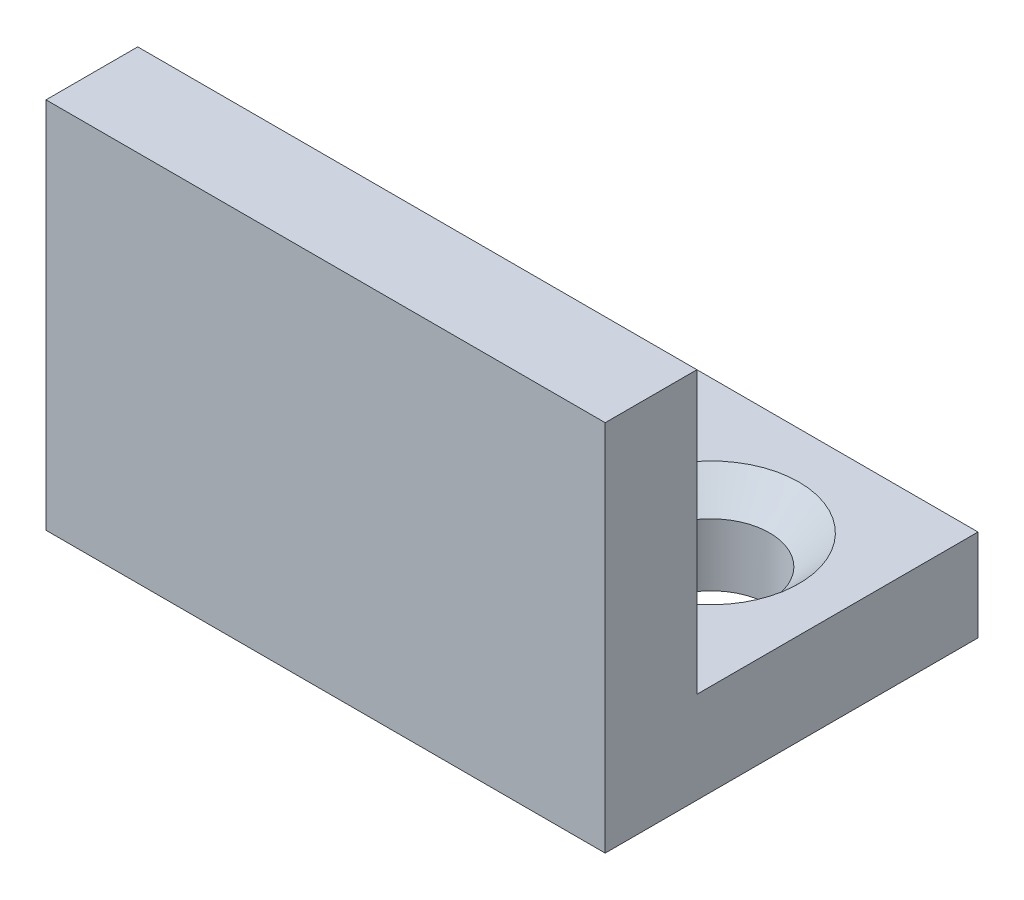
ISO-10303-21;
HEADER;
FILE_DESCRIPTION(('STEP AP214'),'2;1');
FILE_NAME('part.step','',(''),(''),'','','');
FILE_SCHEMA(('AUTOMOTIVE_DESIGN { 1 0 10303 214 1 1 1 1 }'));
ENDSEC;
DATA;
#1=APPLICATION_CONTEXT('core data for automotive mechanical design processes');
#2=APPLICATION_PROTOCOL_DEFINITION('international standard','automotive_design',2000,#1);
#3=PRODUCT_CONTEXT('',#1,'mechanical');
#4=PRODUCT('Part','Part','',(#3));
#5=PRODUCT_RELATED_PRODUCT_CATEGORY('part','',(#4));
#6=PRODUCT_DEFINITION_FORMATION('','',#4);
#7=PRODUCT_DEFINITION_CONTEXT('part definition',#1,'design');
#8=PRODUCT_DEFINITION('design','',#6,#7);
#9=PRODUCT_DEFINITION_SHAPE('','',#8);
#10=(LENGTH_UNIT() NAMED_UNIT(*) SI_UNIT(.MILLI.,.METRE.));
#11=(NAMED_UNIT(*) PLANE_ANGLE_UNIT() SI_UNIT($,.RADIAN.));
#12=(NAMED_UNIT(*) SI_UNIT($,.STERADIAN.) SOLID_ANGLE_UNIT());
#13=UNCERTAINTY_MEASURE_WITH_UNIT(LENGTH_MEASURE(1.E-05),#10,'distance_accuracy_value','');
#14=(GEOMETRIC_REPRESENTATION_CONTEXT(3) GLOBAL_UNCERTAINTY_ASSIGNED_CONTEXT((#13)) GLOBAL_UNIT_ASSIGNED_CONTEXT((#10,
#11,#12)) REPRESENTATION_CONTEXT('',''));
#15=CARTESIAN_POINT('',(0.,0.,0.));
#16=DIRECTION('',(0.,0.,1.));
#17=DIRECTION('',(1.,0.,0.));
#18=AXIS2_PLACEMENT_3D('',#15,#16,#17);
#19=CARTESIAN_POINT('',(9.525,0.,0.));
#20=DIRECTION('',(0.,1.,0.));
#21=DIRECTION('',(0.,0.,1.));
#22=AXIS2_PLACEMENT_3D('',#19,#20,#21);
#23=PLANE('',#22);
#24=CARTESIAN_POINT('',(5.,0.,-5.));
#25=DIRECTION('',(0.,1.,0.));
#26=DIRECTION('',(0.,0.,1.));
#27=AXIS2_PLACEMENT_3D('',#24,#25,#26);
#28=CIRCLE('',#27,3.00000000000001);
#29=CARTESIAN_POINT('',(5.,0.,-1.99999999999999));
#30=VERTEX_POINT('',#29);
#31=EDGE_CURVE('E41',#30,#30,#28,.F.);
#32=ORIENTED_EDGE('',*,*,#31,.T.);
#33=EDGE_LOOP('',(#32));
#34=FACE_BOUND('',#33,.T.);
#35=CARTESIAN_POINT('',(-5.,0.,-5.));
#36=DIRECTION('',(0.,1.,0.));
#37=DIRECTION('',(0.,0.,1.));
#38=AXIS2_PLACEMENT_3D('',#35,#36,#37);
#39=CIRCLE('',#38,3.00000000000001);
#40=CARTESIAN_POINT('',(-5.,0.,-1.99999999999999));
#41=VERTEX_POINT('',#40);
#42=EDGE_CURVE('E146',#41,#41,#39,.F.);
#43=ORIENTED_EDGE('',*,*,#42,.T.);
#44=EDGE_LOOP('',(#43));
#45=FACE_BOUND('',#44,.T.);
#46=DIRECTION('',(0.,0.,-1.));
#47=VECTOR('',#46,1.);
#48=CARTESIAN_POINT('',(-9.525,0.,0.));
#49=LINE('',#48,#47);
#50=CARTESIAN_POINT('',(-9.525,0.,0.));
#51=VERTEX_POINT('',#50);
#52=CARTESIAN_POINT('',(-9.525,0.,-9.575));
#53=VERTEX_POINT('',#52);
#54=EDGE_CURVE('E120',#51,#53,#49,.T.);
#55=ORIENTED_EDGE('',*,*,#54,.F.);
#56=DIRECTION('',(-1.,0.,0.));
#57=VECTOR('',#56,1.);
#58=CARTESIAN_POINT('',(9.525,0.,0.));
#59=LINE('',#58,#57);
#60=CARTESIAN_POINT('',(9.525,0.,0.));
#61=VERTEX_POINT('',#60);
#62=EDGE_CURVE('E49',#61,#51,#59,.T.);
#63=ORIENTED_EDGE('',*,*,#62,.F.);
#64=DIRECTION('',(0.,0.,-1.));
#65=VECTOR('',#64,1.);
#66=CARTESIAN_POINT('',(9.525,0.,0.));
#67=LINE('',#66,#65);
#68=CARTESIAN_POINT('',(9.525,0.,-9.575));
#69=VERTEX_POINT('',#68);
#70=EDGE_CURVE('E136',#61,#69,#67,.T.);
#71=ORIENTED_EDGE('',*,*,#70,.T.);
#72=DIRECTION('',(-1.,0.,0.));
#73=VECTOR('',#72,1.);
#74=CARTESIAN_POINT('',(9.525,0.,-9.575));
#75=LINE('',#74,#73);
#76=EDGE_CURVE('E84',#69,#53,#75,.T.);
#77=ORIENTED_EDGE('',*,*,#76,.T.);
#78=EDGE_LOOP('',(#55,#63,#71,#77));
#79=FACE_BOUND('',#78,.T.);
#80=ADVANCED_FACE('F32',(#34,#45,#79),#23,.T.);
#81=CARTESIAN_POINT('',(9.525,9.57499999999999,0.));
#82=DIRECTION('',(0.,0.,-1.));
#83=DIRECTION('',(0.,1.,0.));
#84=AXIS2_PLACEMENT_3D('',#81,#82,#83);
#85=PLANE('',#84);
#86=DIRECTION('',(0.,-1.,0.));
#87=VECTOR('',#86,1.);
#88=CARTESIAN_POINT('',(-9.525,9.57499999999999,0.));
#89=LINE('',#88,#87);
#90=CARTESIAN_POINT('',(-9.525,9.57499999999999,0.));
#91=VERTEX_POINT('',#90);
#92=EDGE_CURVE('E133',#91,#51,#89,.T.);
#93=ORIENTED_EDGE('',*,*,#92,.F.);
#94=DIRECTION('',(-1.,0.,0.));
#95=VECTOR('',#94,1.);
#96=CARTESIAN_POINT('',(9.525,9.57499999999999,0.));
#97=LINE('',#96,#95);
#98=CARTESIAN_POINT('',(9.525,9.57499999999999,0.));
#99=VERTEX_POINT('',#98);
#100=EDGE_CURVE('E72',#99,#91,#97,.T.);
#101=ORIENTED_EDGE('',*,*,#100,.F.);
#102=DIRECTION('',(0.,-1.,0.));
#103=VECTOR('',#102,1.);
#104=CARTESIAN_POINT('',(9.525,9.57499999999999,0.));
#105=LINE('',#104,#103);
#106=EDGE_CURVE('E110',#99,#61,#105,.T.);
#107=ORIENTED_EDGE('',*,*,#106,.T.);
#108=ORIENTED_EDGE('',*,*,#62,.T.);
#109=EDGE_LOOP('',(#93,#101,#107,#108));
#110=FACE_BOUND('',#109,.T.);
#111=ADVANCED_FACE('F175',(#110),#85,.T.);
#112=CARTESIAN_POINT('',(9.525,9.57499999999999,3.125));
#113=DIRECTION('',(0.,1.,0.));
#114=DIRECTION('',(0.,0.,1.));
#115=AXIS2_PLACEMENT_3D('',#112,#113,#114);
#116=PLANE('',#115);
#117=DIRECTION('',(0.,0.,-1.));
#118=VECTOR('',#117,1.);
#119=CARTESIAN_POINT('',(-9.525,9.57499999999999,3.125));
#120=LINE('',#119,#118);
#121=CARTESIAN_POINT('',(-9.525,9.57499999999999,3.125));
#122=VERTEX_POINT('',#121);
#123=EDGE_CURVE('E97',#122,#91,#120,.T.);
#124=ORIENTED_EDGE('',*,*,#123,.F.);
#125=DIRECTION('',(-1.,0.,0.));
#126=VECTOR('',#125,1.);
#127=CARTESIAN_POINT('',(9.525,9.57499999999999,3.125));
#128=LINE('',#127,#126);
#129=CARTESIAN_POINT('',(9.525,9.57499999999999,3.125));
#130=VERTEX_POINT('',#129);
#131=EDGE_CURVE('E92',#130,#122,#128,.T.);
#132=ORIENTED_EDGE('',*,*,#131,.F.);
#133=DIRECTION('',(0.,0.,-1.));
#134=VECTOR('',#133,1.);
#135=CARTESIAN_POINT('',(9.525,9.57499999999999,3.125));
#136=LINE('',#135,#134);
#137=EDGE_CURVE('E95',#130,#99,#136,.T.);
#138=ORIENTED_EDGE('',*,*,#137,.T.);
#139=ORIENTED_EDGE('',*,*,#100,.T.);
#140=EDGE_LOOP('',(#124,#132,#138,#139));
#141=FACE_BOUND('',#140,.T.);
#142=ADVANCED_FACE('F94',(#141),#116,.T.);
#143=CARTESIAN_POINT('',(9.525,-3.12500000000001,3.125));
#144=DIRECTION('',(0.,0.,1.));
#145=DIRECTION('',(1.,0.,0.));
#146=AXIS2_PLACEMENT_3D('',#143,#144,#145);
#147=PLANE('',#146);
#148=DIRECTION('',(0.,1.,0.));
#149=VECTOR('',#148,1.);
#150=CARTESIAN_POINT('',(-9.525,-3.12500000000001,3.125));
#151=LINE('',#150,#149);
#152=CARTESIAN_POINT('',(-9.525,-3.12500000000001,3.125));
#153=VERTEX_POINT('',#152);
#154=EDGE_CURVE('E130',#153,#122,#151,.T.);
#155=ORIENTED_EDGE('',*,*,#154,.F.);
#156=DIRECTION('',(-1.,0.,0.));
#157=VECTOR('',#156,1.);
#158=CARTESIAN_POINT('',(9.525,-3.12500000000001,3.125));
#159=LINE('',#158,#157);
#160=CARTESIAN_POINT('',(9.525,-3.12500000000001,3.125));
#161=VERTEX_POINT('',#160);
#162=EDGE_CURVE('E102',#161,#153,#159,.T.);
#163=ORIENTED_EDGE('',*,*,#162,.F.);
#164=DIRECTION('',(0.,1.,0.));
#165=VECTOR('',#164,1.);
#166=CARTESIAN_POINT('',(9.525,-3.12500000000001,3.125));
#167=LINE('',#166,#165);
#168=EDGE_CURVE('E108',#161,#130,#167,.T.);
#169=ORIENTED_EDGE('',*,*,#168,.T.);
#170=ORIENTED_EDGE('',*,*,#131,.T.);
#171=EDGE_LOOP('',(#155,#163,#169,#170));
#172=FACE_BOUND('',#171,.T.);
#173=ADVANCED_FACE('F112',(#172),#147,.T.);
#174=CARTESIAN_POINT('',(9.525,-3.125,-9.575));
#175=DIRECTION('',(0.,-1.,0.));
#176=DIRECTION('',(0.,0.,-1.));
#177=AXIS2_PLACEMENT_3D('',#174,#175,#176);
#178=PLANE('',#177);
#179=CARTESIAN_POINT('',(5.,-3.125,-5.));
#180=DIRECTION('',(0.,-1.,0.));
#181=DIRECTION('',(0.,0.,-1.));
#182=AXIS2_PLACEMENT_3D('',#179,#180,#181);
#183=CIRCLE('',#182,2.);
#184=CARTESIAN_POINT('',(5.,-3.125,-7.));
#185=VERTEX_POINT('',#184);
#186=EDGE_CURVE('E165',#185,#185,#183,.F.);
#187=ORIENTED_EDGE('',*,*,#186,.T.);
#188=EDGE_LOOP('',(#187));
#189=FACE_BOUND('',#188,.T.);
#190=CARTESIAN_POINT('',(-5.,-3.125,-5.));
#191=DIRECTION('',(0.,-1.,0.));
#192=DIRECTION('',(0.,0.,-1.));
#193=AXIS2_PLACEMENT_3D('',#190,#191,#192);
#194=CIRCLE('',#193,2.);
#195=CARTESIAN_POINT('',(-5.,-3.125,-7.));
#196=VERTEX_POINT('',#195);
#197=EDGE_CURVE('E124',#196,#196,#194,.F.);
#198=ORIENTED_EDGE('',*,*,#197,.T.);
#199=EDGE_LOOP('',(#198));
#200=FACE_BOUND('',#199,.T.);
#201=DIRECTION('',(0.,0.,1.));
#202=VECTOR('',#201,1.);
#203=CARTESIAN_POINT('',(-9.525,-3.125,-9.575));
#204=LINE('',#203,#202);
#205=CARTESIAN_POINT('',(-9.525,-3.125,-9.575));
#206=VERTEX_POINT('',#205);
#207=EDGE_CURVE('E127',#206,#153,#204,.T.);
#208=ORIENTED_EDGE('',*,*,#207,.F.);
#209=DIRECTION('',(-1.,0.,0.));
#210=VECTOR('',#209,1.);
#211=CARTESIAN_POINT('',(9.525,-3.125,-9.575));
#212=LINE('',#211,#210);
#213=CARTESIAN_POINT('',(9.525,-3.125,-9.575));
#214=VERTEX_POINT('',#213);
#215=EDGE_CURVE('E141',#214,#206,#212,.T.);
#216=ORIENTED_EDGE('',*,*,#215,.F.);
#217=DIRECTION('',(0.,0.,1.));
#218=VECTOR('',#217,1.);
#219=CARTESIAN_POINT('',(9.525,-3.125,-9.575));
#220=LINE('',#219,#218);
#221=EDGE_CURVE('E113',#214,#161,#220,.T.);
#222=ORIENTED_EDGE('',*,*,#221,.T.);
#223=ORIENTED_EDGE('',*,*,#162,.T.);
#224=EDGE_LOOP('',(#208,#216,#222,#223));
#225=FACE_BOUND('',#224,.T.);
#226=ADVANCED_FACE('F189',(#189,#200,#225),#178,.T.);
#227=CARTESIAN_POINT('',(9.525,0.,-9.575));
#228=DIRECTION('',(0.,0.,-1.));
#229=DIRECTION('',(-1.,0.,0.));
#230=AXIS2_PLACEMENT_3D('',#227,#228,#229);
#231=PLANE('',#230);
#232=DIRECTION('',(0.,-1.,0.));
#233=VECTOR('',#232,1.);
#234=CARTESIAN_POINT('',(-9.525,0.,-9.575));
#235=LINE('',#234,#233);
#236=EDGE_CURVE('E123',#53,#206,#235,.T.);
#237=ORIENTED_EDGE('',*,*,#236,.F.);
#238=ORIENTED_EDGE('',*,*,#76,.F.);
#239=DIRECTION('',(0.,-1.,0.));
#240=VECTOR('',#239,1.);
#241=CARTESIAN_POINT('',(9.525,0.,-9.575));
#242=LINE('',#241,#240);
#243=EDGE_CURVE('E115',#69,#214,#242,.T.);
#244=ORIENTED_EDGE('',*,*,#243,.T.);
#245=ORIENTED_EDGE('',*,*,#215,.T.);
#246=EDGE_LOOP('',(#237,#238,#244,#245));
#247=FACE_BOUND('',#246,.T.);
#248=ADVANCED_FACE('F171',(#247),#231,.T.);
#249=CARTESIAN_POINT('',(9.525,0.,0.));
#250=DIRECTION('',(-1.,0.,0.));
#251=DIRECTION('',(0.,0.,1.));
#252=AXIS2_PLACEMENT_3D('',#249,#250,#251);
#253=PLANE('',#252);
#254=ORIENTED_EDGE('',*,*,#70,.F.);
#255=ORIENTED_EDGE('',*,*,#106,.F.);
#256=ORIENTED_EDGE('',*,*,#137,.F.);
#257=ORIENTED_EDGE('',*,*,#168,.F.);
#258=ORIENTED_EDGE('',*,*,#221,.F.);
#259=ORIENTED_EDGE('',*,*,#243,.F.);
#260=EDGE_LOOP('',(#254,#255,#256,#257,#258,#259));
#261=FACE_BOUND('',#260,.T.);
#262=ADVANCED_FACE('F106',(#261),#253,.F.);
#263=CARTESIAN_POINT('',(-9.525,0.,0.));
#264=DIRECTION('',(-1.,0.,0.));
#265=DIRECTION('',(0.,0.,1.));
#266=AXIS2_PLACEMENT_3D('',#263,#264,#265);
#267=PLANE('',#266);
#268=ORIENTED_EDGE('',*,*,#54,.T.);
#269=ORIENTED_EDGE('',*,*,#236,.T.);
#270=ORIENTED_EDGE('',*,*,#207,.T.);
#271=ORIENTED_EDGE('',*,*,#154,.T.);
#272=ORIENTED_EDGE('',*,*,#123,.T.);
#273=ORIENTED_EDGE('',*,*,#92,.T.);
#274=EDGE_LOOP('',(#268,#269,#270,#271,#272,#273));
#275=FACE_BOUND('',#274,.T.);
#276=ADVANCED_FACE('F174',(#275),#267,.T.);
#277=CARTESIAN_POINT('',(-5.,-3.12600000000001,-5.));
#278=DIRECTION('',(0.,1.,0.));
#279=DIRECTION('',(0.,0.,1.));
#280=AXIS2_PLACEMENT_3D('',#277,#278,#279);
#281=CYLINDRICAL_SURFACE('',#280,2.);
#282=CARTESIAN_POINT('',(-5.,-1.00000000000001,-5.));
#283=DIRECTION('',(0.,1.,0.));
#284=DIRECTION('',(0.,0.,1.));
#285=AXIS2_PLACEMENT_3D('',#282,#283,#284);
#286=CIRCLE('',#285,2.);
#287=CARTESIAN_POINT('',(-5.,-1.00000000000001,-3.));
#288=VERTEX_POINT('',#287);
#289=EDGE_CURVE('E11',#288,#288,#286,.T.);
#290=ORIENTED_EDGE('',*,*,#289,.T.);
#291=EDGE_LOOP('',(#290));
#292=FACE_BOUND('',#291,.T.);
#293=ORIENTED_EDGE('',*,*,#197,.F.);
#294=EDGE_LOOP('',(#293));
#295=FACE_BOUND('',#294,.T.);
#296=ADVANCED_FACE('F161',(#292,#295),#281,.F.);
#297=CARTESIAN_POINT('',(5.,-3.12600000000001,-5.));
#298=DIRECTION('',(0.,1.,0.));
#299=DIRECTION('',(0.,0.,1.));
#300=AXIS2_PLACEMENT_3D('',#297,#298,#299);
#301=CYLINDRICAL_SURFACE('',#300,2.);
#302=CARTESIAN_POINT('',(5.,-1.00000000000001,-5.));
#303=DIRECTION('',(0.,1.,0.));
#304=DIRECTION('',(0.,0.,1.));
#305=AXIS2_PLACEMENT_3D('',#302,#303,#304);
#306=CIRCLE('',#305,2.);
#307=CARTESIAN_POINT('',(5.,-1.00000000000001,-3.));
#308=VERTEX_POINT('',#307);
#309=EDGE_CURVE('E138',#308,#308,#306,.T.);
#310=ORIENTED_EDGE('',*,*,#309,.T.);
#311=EDGE_LOOP('',(#310));
#312=FACE_BOUND('',#311,.T.);
#313=ORIENTED_EDGE('',*,*,#186,.F.);
#314=EDGE_LOOP('',(#313));
#315=FACE_BOUND('',#314,.T.);
#316=ADVANCED_FACE('F156',(#312,#315),#301,.F.);
#317=CARTESIAN_POINT('',(5.,-1.00000000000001,-5.));
#318=DIRECTION('',(0.,1.,0.));
#319=DIRECTION('',(0.,0.,1.));
#320=AXIS2_PLACEMENT_3D('',#317,#318,#319);
#321=CONICAL_SURFACE('',#320,2.,0.78539816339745);
#322=ORIENTED_EDGE('',*,*,#31,.F.);
#323=EDGE_LOOP('',(#322));
#324=FACE_BOUND('',#323,.T.);
#325=ORIENTED_EDGE('',*,*,#309,.F.);
#326=EDGE_LOOP('',(#325));
#327=FACE_BOUND('',#326,.T.);
#328=ADVANCED_FACE('F153',(#324,#327),#321,.F.);
#329=CARTESIAN_POINT('',(-5.,-1.00000000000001,-5.));
#330=DIRECTION('',(0.,1.,0.));
#331=DIRECTION('',(0.,0.,1.));
#332=AXIS2_PLACEMENT_3D('',#329,#330,#331);
#333=CONICAL_SURFACE('',#332,2.,0.78539816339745);
#334=ORIENTED_EDGE('',*,*,#42,.F.);
#335=EDGE_LOOP('',(#334));
#336=FACE_BOUND('',#335,.T.);
#337=ORIENTED_EDGE('',*,*,#289,.F.);
#338=EDGE_LOOP('',(#337));
#339=FACE_BOUND('',#338,.T.);
#340=ADVANCED_FACE('F34',(#336,#339),#333,.F.);
#341=CLOSED_SHELL('',(#80,#111,#142,#173,#226,#248,#262,#276,#296,#316,#328,#340));
#342=MANIFOLD_SOLID_BREP('B2',#341);
#343=ADVANCED_BREP_SHAPE_REPRESENTATION('',(#18,#342),#14);
#344=SHAPE_DEFINITION_REPRESENTATION(#9,#343);
ENDSEC;
END-ISO-10303-21;
